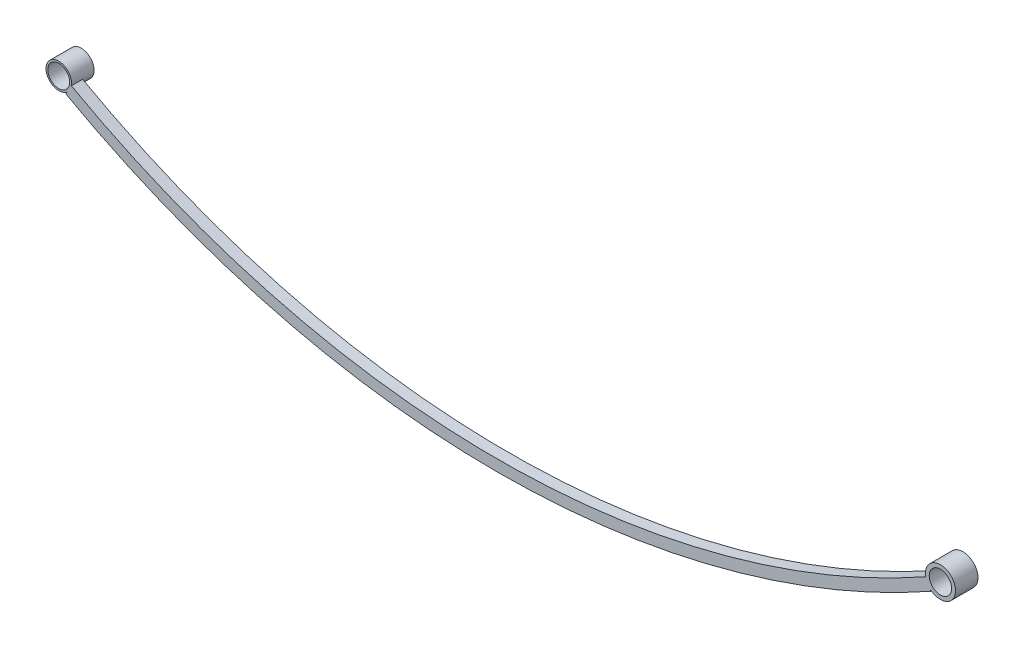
from build123d import *

# Parameters (mm, degrees)
ESQUISSE1_R        = 11.348509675
ESQUISSE1_R_2      = 9.74583405
EXTRUSION1_DEPTH   = 20
ESQUISSE1_R_3      = 13.383248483
ESQUISSE1_R_4      = 9.955414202
EXTRUSION1_2_DEPTH = 20
EXTRUSION2_DEPTH   = 10


with BuildPart() as part:
    # Esquisse1 → Extrusion1 (new body)
    with BuildSketch(Plane.XY):
        with Locations((-504.011079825, -292.484987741)):
            Circle(ESQUISSE1_R)
        with Locations((-504.011079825, -292.484987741)):
            Circle(ESQUISSE1_R_2, mode=Mode.SUBTRACT)
    extrude(amount=EXTRUSION1_DEPTH)



with BuildPart() as body_2:
    # Esquisse1 → Extrusion1 2 (new body)
    with BuildSketch(Plane.XY):
        with Locations((279.256364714, -290.310979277)):
            Circle(ESQUISSE1_R_3)
        with Locations((279.256364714, -290.310979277)):
            Circle(ESQUISSE1_R_4, mode=Mode.SUBTRACT)
    extrude(amount=EXTRUSION1_2_DEPTH)


with BuildPart() as part_1:
    add(part.part)

    add(body_2.part)  # Extrusion2 merges body 2
    # Esquisse2 → Extrusion2 (add)
    with BuildSketch(Plane.XY.offset(20)):
        with BuildLine():
            Line((-497.700488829, -303.243130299), (-492.843254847, -294.502004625))
            ThreePointArc((-492.843254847, -294.502004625), (-113.146005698, -392.450469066), (266.102787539, -292.779733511))
            Line((266.102787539, -292.779733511), (270.999643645, -301.498724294))
            ThreePointArc((270.999643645, -301.498724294), (-113.123312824, -402.450443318), (-497.700488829, -303.243130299))
        make_face()
    extrude(amount=-EXTRUSION2_DEPTH)


solid = part_1.part
